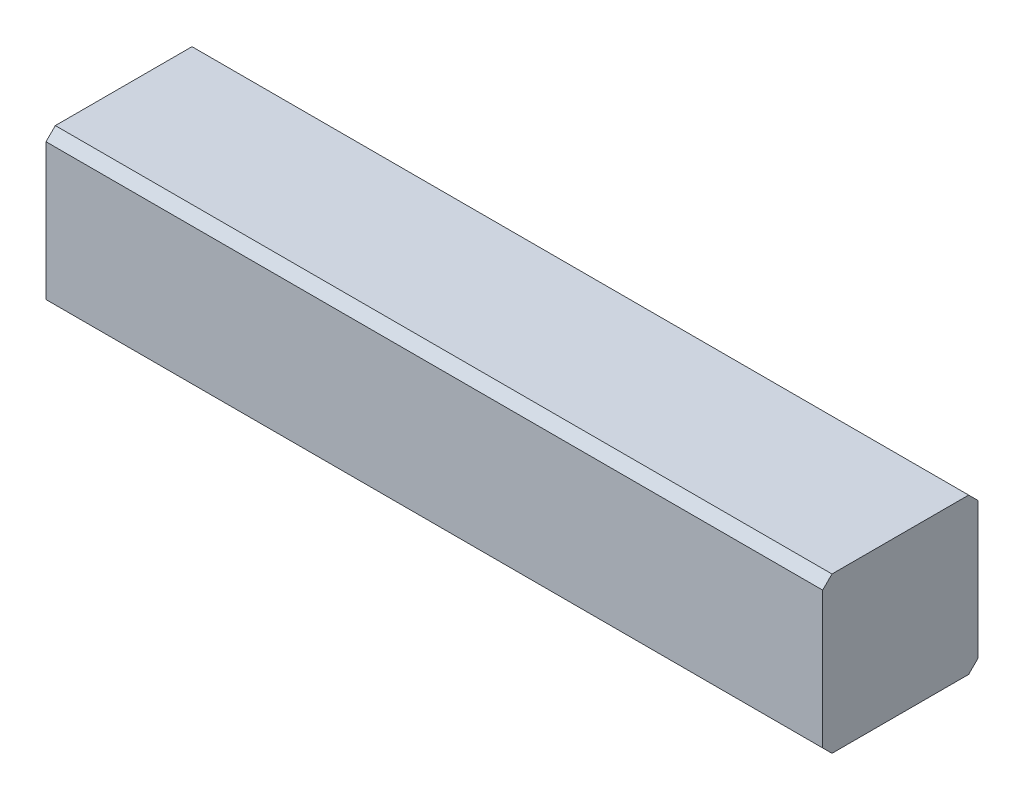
ISO-10303-21;
HEADER;
FILE_DESCRIPTION(('STEP AP214'),'2;1');
FILE_NAME('part.step','',(''),(''),'','','');
FILE_SCHEMA(('AUTOMOTIVE_DESIGN { 1 0 10303 214 1 1 1 1 }'));
ENDSEC;
DATA;
#1=APPLICATION_CONTEXT('core data for automotive mechanical design processes');
#2=APPLICATION_PROTOCOL_DEFINITION('international standard','automotive_design',2000,#1);
#3=PRODUCT_CONTEXT('',#1,'mechanical');
#4=PRODUCT('Part','Part','',(#3));
#5=PRODUCT_RELATED_PRODUCT_CATEGORY('part','',(#4));
#6=PRODUCT_DEFINITION_FORMATION('','',#4);
#7=PRODUCT_DEFINITION_CONTEXT('part definition',#1,'design');
#8=PRODUCT_DEFINITION('design','',#6,#7);
#9=PRODUCT_DEFINITION_SHAPE('','',#8);
#10=(LENGTH_UNIT() NAMED_UNIT(*) SI_UNIT(.MILLI.,.METRE.));
#11=(NAMED_UNIT(*) PLANE_ANGLE_UNIT() SI_UNIT($,.RADIAN.));
#12=(NAMED_UNIT(*) SI_UNIT($,.STERADIAN.) SOLID_ANGLE_UNIT());
#13=UNCERTAINTY_MEASURE_WITH_UNIT(LENGTH_MEASURE(1.E-05),#10,'distance_accuracy_value','');
#14=(GEOMETRIC_REPRESENTATION_CONTEXT(3) GLOBAL_UNCERTAINTY_ASSIGNED_CONTEXT((#13)) GLOBAL_UNIT_ASSIGNED_CONTEXT((#10,
#11,#12)) REPRESENTATION_CONTEXT('',''));
#15=CARTESIAN_POINT('',(0.,0.,0.));
#16=DIRECTION('',(0.,0.,1.));
#17=DIRECTION('',(1.,0.,0.));
#18=AXIS2_PLACEMENT_3D('',#15,#16,#17);
#19=CARTESIAN_POINT('',(0.,5.,5.));
#20=DIRECTION('',(1.,0.,0.));
#21=DIRECTION('',(0.,0.,-1.));
#22=AXIS2_PLACEMENT_3D('',#19,#20,#21);
#23=PLANE('',#22);
#24=DIRECTION('',(0.,0.,-1.));
#25=VECTOR('',#24,1.);
#26=CARTESIAN_POINT('',(0.,0.,5.));
#27=LINE('',#26,#25);
#28=CARTESIAN_POINT('',(0.,0.,4.7));
#29=VERTEX_POINT('',#28);
#30=CARTESIAN_POINT('',(0.,0.,0.3));
#31=VERTEX_POINT('',#30);
#32=EDGE_CURVE('E11',#29,#31,#27,.T.);
#33=ORIENTED_EDGE('',*,*,#32,.F.);
#34=DIRECTION('',(0.,-0.707106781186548,-0.707106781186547));
#35=VECTOR('',#34,1.);
#36=CARTESIAN_POINT('',(0.,0.3,5.));
#37=LINE('',#36,#35);
#38=CARTESIAN_POINT('',(0.,0.3,5.));
#39=VERTEX_POINT('',#38);
#40=EDGE_CURVE('E124',#39,#29,#37,.T.);
#41=ORIENTED_EDGE('',*,*,#40,.F.);
#42=DIRECTION('',(0.,-1.,0.));
#43=VECTOR('',#42,1.);
#44=CARTESIAN_POINT('',(0.,5.,5.));
#45=LINE('',#44,#43);
#46=CARTESIAN_POINT('',(0.,4.7,5.));
#47=VERTEX_POINT('',#46);
#48=EDGE_CURVE('E161',#47,#39,#45,.T.);
#49=ORIENTED_EDGE('',*,*,#48,.F.);
#50=DIRECTION('',(0.,-0.707106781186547,0.707106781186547));
#51=VECTOR('',#50,1.);
#52=CARTESIAN_POINT('',(0.,5.,4.7));
#53=LINE('',#52,#51);
#54=CARTESIAN_POINT('',(0.,5.,4.7));
#55=VERTEX_POINT('',#54);
#56=EDGE_CURVE('E71',#55,#47,#53,.T.);
#57=ORIENTED_EDGE('',*,*,#56,.F.);
#58=DIRECTION('',(0.,0.,-1.));
#59=VECTOR('',#58,1.);
#60=CARTESIAN_POINT('',(0.,5.,5.));
#61=LINE('',#60,#59);
#62=CARTESIAN_POINT('',(0.,5.,0.3));
#63=VERTEX_POINT('',#62);
#64=EDGE_CURVE('E151',#55,#63,#61,.T.);
#65=ORIENTED_EDGE('',*,*,#64,.T.);
#66=DIRECTION('',(0.,0.707106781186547,0.707106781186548));
#67=VECTOR('',#66,1.);
#68=CARTESIAN_POINT('',(0.,4.7,0.));
#69=LINE('',#68,#67);
#70=CARTESIAN_POINT('',(0.,4.7,0.));
#71=VERTEX_POINT('',#70);
#72=EDGE_CURVE('E194',#71,#63,#69,.T.);
#73=ORIENTED_EDGE('',*,*,#72,.F.);
#74=DIRECTION('',(0.,-1.,0.));
#75=VECTOR('',#74,1.);
#76=CARTESIAN_POINT('',(0.,5.,0.));
#77=LINE('',#76,#75);
#78=CARTESIAN_POINT('',(0.,0.3,0.));
#79=VERTEX_POINT('',#78);
#80=EDGE_CURVE('E162',#71,#79,#77,.T.);
#81=ORIENTED_EDGE('',*,*,#80,.T.);
#82=DIRECTION('',(0.,0.707106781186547,-0.707106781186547));
#83=VECTOR('',#82,1.);
#84=CARTESIAN_POINT('',(0.,0.,0.3));
#85=LINE('',#84,#83);
#86=EDGE_CURVE('E197',#31,#79,#85,.T.);
#87=ORIENTED_EDGE('',*,*,#86,.F.);
#88=EDGE_LOOP('',(#33,#41,#49,#57,#65,#73,#81,#87));
#89=FACE_BOUND('',#88,.T.);
#90=ADVANCED_FACE('F42',(#89),#23,.F.);
#91=CARTESIAN_POINT('',(0.,0.,5.));
#92=DIRECTION('',(0.,1.,0.));
#93=DIRECTION('',(0.,0.,1.));
#94=AXIS2_PLACEMENT_3D('',#91,#92,#93);
#95=PLANE('',#94);
#96=DIRECTION('',(0.,0.,-1.));
#97=VECTOR('',#96,1.);
#98=CARTESIAN_POINT('',(25.,0.,5.));
#99=LINE('',#98,#97);
#100=CARTESIAN_POINT('',(25.,0.,4.7));
#101=VERTEX_POINT('',#100);
#102=CARTESIAN_POINT('',(25.,0.,0.3));
#103=VERTEX_POINT('',#102);
#104=EDGE_CURVE('E50',#101,#103,#99,.T.);
#105=ORIENTED_EDGE('',*,*,#104,.F.);
#106=DIRECTION('',(-1.,0.,0.));
#107=VECTOR('',#106,1.);
#108=CARTESIAN_POINT('',(25.,0.,4.7));
#109=LINE('',#108,#107);
#110=EDGE_CURVE('E121',#101,#29,#109,.T.);
#111=ORIENTED_EDGE('',*,*,#110,.T.);
#112=ORIENTED_EDGE('',*,*,#32,.T.);
#113=DIRECTION('',(-1.,0.,0.));
#114=VECTOR('',#113,1.);
#115=CARTESIAN_POINT('',(25.,0.,0.3));
#116=LINE('',#115,#114);
#117=EDGE_CURVE('E130',#103,#31,#116,.T.);
#118=ORIENTED_EDGE('',*,*,#117,.F.);
#119=EDGE_LOOP('',(#105,#111,#112,#118));
#120=FACE_BOUND('',#119,.T.);
#121=ADVANCED_FACE('F144',(#120),#95,.F.);
#122=CARTESIAN_POINT('',(25.,0.,5.));
#123=DIRECTION('',(-1.,0.,0.));
#124=DIRECTION('',(0.,0.,1.));
#125=AXIS2_PLACEMENT_3D('',#122,#123,#124);
#126=PLANE('',#125);
#127=DIRECTION('',(0.,1.,0.));
#128=VECTOR('',#127,1.);
#129=CARTESIAN_POINT('',(25.,0.,5.));
#130=LINE('',#129,#128);
#131=CARTESIAN_POINT('',(25.,0.3,5.));
#132=VERTEX_POINT('',#131);
#133=CARTESIAN_POINT('',(25.,4.7,5.));
#134=VERTEX_POINT('',#133);
#135=EDGE_CURVE('E139',#132,#134,#130,.T.);
#136=ORIENTED_EDGE('',*,*,#135,.F.);
#137=DIRECTION('',(0.,-0.707106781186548,-0.707106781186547));
#138=VECTOR('',#137,1.);
#139=CARTESIAN_POINT('',(25.,0.3,5.));
#140=LINE('',#139,#138);
#141=EDGE_CURVE('E60',#132,#101,#140,.T.);
#142=ORIENTED_EDGE('',*,*,#141,.T.);
#143=ORIENTED_EDGE('',*,*,#104,.T.);
#144=DIRECTION('',(0.,0.707106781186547,-0.707106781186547));
#145=VECTOR('',#144,1.);
#146=CARTESIAN_POINT('',(25.,0.,0.3));
#147=LINE('',#146,#145);
#148=CARTESIAN_POINT('',(25.,0.3,0.));
#149=VERTEX_POINT('',#148);
#150=EDGE_CURVE('E141',#103,#149,#147,.T.);
#151=ORIENTED_EDGE('',*,*,#150,.T.);
#152=DIRECTION('',(0.,1.,0.));
#153=VECTOR('',#152,1.);
#154=CARTESIAN_POINT('',(25.,0.,0.));
#155=LINE('',#154,#153);
#156=CARTESIAN_POINT('',(25.,4.7,0.));
#157=VERTEX_POINT('',#156);
#158=EDGE_CURVE('E157',#149,#157,#155,.T.);
#159=ORIENTED_EDGE('',*,*,#158,.T.);
#160=DIRECTION('',(0.,0.707106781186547,0.707106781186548));
#161=VECTOR('',#160,1.);
#162=CARTESIAN_POINT('',(25.,4.7,0.));
#163=LINE('',#162,#161);
#164=CARTESIAN_POINT('',(25.,5.,0.3));
#165=VERTEX_POINT('',#164);
#166=EDGE_CURVE('E203',#157,#165,#163,.T.);
#167=ORIENTED_EDGE('',*,*,#166,.T.);
#168=DIRECTION('',(0.,0.,-1.));
#169=VECTOR('',#168,1.);
#170=CARTESIAN_POINT('',(25.,5.,5.));
#171=LINE('',#170,#169);
#172=CARTESIAN_POINT('',(25.,5.,4.7));
#173=VERTEX_POINT('',#172);
#174=EDGE_CURVE('E146',#173,#165,#171,.T.);
#175=ORIENTED_EDGE('',*,*,#174,.F.);
#176=DIRECTION('',(0.,-0.707106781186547,0.707106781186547));
#177=VECTOR('',#176,1.);
#178=CARTESIAN_POINT('',(25.,5.,4.7));
#179=LINE('',#178,#177);
#180=EDGE_CURVE('E191',#173,#134,#179,.T.);
#181=ORIENTED_EDGE('',*,*,#180,.T.);
#182=EDGE_LOOP('',(#136,#142,#143,#151,#159,#167,#175,#181));
#183=FACE_BOUND('',#182,.T.);
#184=ADVANCED_FACE('F135',(#183),#126,.F.);
#185=CARTESIAN_POINT('',(25.,5.,5.));
#186=DIRECTION('',(0.,-1.,0.));
#187=DIRECTION('',(0.,0.,-1.));
#188=AXIS2_PLACEMENT_3D('',#185,#186,#187);
#189=PLANE('',#188);
#190=ORIENTED_EDGE('',*,*,#174,.T.);
#191=DIRECTION('',(-1.,0.,0.));
#192=VECTOR('',#191,1.);
#193=CARTESIAN_POINT('',(25.,5.,0.3));
#194=LINE('',#193,#192);
#195=EDGE_CURVE('E181',#165,#63,#194,.T.);
#196=ORIENTED_EDGE('',*,*,#195,.T.);
#197=ORIENTED_EDGE('',*,*,#64,.F.);
#198=DIRECTION('',(-1.,0.,0.));
#199=VECTOR('',#198,1.);
#200=CARTESIAN_POINT('',(25.,5.,4.7));
#201=LINE('',#200,#199);
#202=EDGE_CURVE('E185',#173,#55,#201,.T.);
#203=ORIENTED_EDGE('',*,*,#202,.F.);
#204=EDGE_LOOP('',(#190,#196,#197,#203));
#205=FACE_BOUND('',#204,.T.);
#206=ADVANCED_FACE('F223',(#205),#189,.F.);
#207=CARTESIAN_POINT('',(0.,0.,5.));
#208=DIRECTION('',(0.,0.,1.));
#209=DIRECTION('',(1.,0.,0.));
#210=AXIS2_PLACEMENT_3D('',#207,#208,#209);
#211=PLANE('',#210);
#212=DIRECTION('',(-1.,0.,0.));
#213=VECTOR('',#212,1.);
#214=CARTESIAN_POINT('',(25.,0.3,5.));
#215=LINE('',#214,#213);
#216=EDGE_CURVE('E129',#132,#39,#215,.T.);
#217=ORIENTED_EDGE('',*,*,#216,.F.);
#218=ORIENTED_EDGE('',*,*,#135,.T.);
#219=DIRECTION('',(-1.,0.,0.));
#220=VECTOR('',#219,1.);
#221=CARTESIAN_POINT('',(25.,4.7,5.));
#222=LINE('',#221,#220);
#223=EDGE_CURVE('E188',#134,#47,#222,.T.);
#224=ORIENTED_EDGE('',*,*,#223,.T.);
#225=ORIENTED_EDGE('',*,*,#48,.T.);
#226=EDGE_LOOP('',(#217,#218,#224,#225));
#227=FACE_BOUND('',#226,.T.);
#228=ADVANCED_FACE('F226',(#227),#211,.T.);
#229=CARTESIAN_POINT('',(0.,0.,0.));
#230=DIRECTION('',(0.,0.,1.));
#231=DIRECTION('',(1.,0.,0.));
#232=AXIS2_PLACEMENT_3D('',#229,#230,#231);
#233=PLANE('',#232);
#234=ORIENTED_EDGE('',*,*,#158,.F.);
#235=DIRECTION('',(-1.,0.,0.));
#236=VECTOR('',#235,1.);
#237=CARTESIAN_POINT('',(25.,0.3,0.));
#238=LINE('',#237,#236);
#239=EDGE_CURVE('E174',#149,#79,#238,.T.);
#240=ORIENTED_EDGE('',*,*,#239,.T.);
#241=ORIENTED_EDGE('',*,*,#80,.F.);
#242=DIRECTION('',(-1.,0.,0.));
#243=VECTOR('',#242,1.);
#244=CARTESIAN_POINT('',(25.,4.7,0.));
#245=LINE('',#244,#243);
#246=EDGE_CURVE('E178',#157,#71,#245,.T.);
#247=ORIENTED_EDGE('',*,*,#246,.F.);
#248=EDGE_LOOP('',(#234,#240,#241,#247));
#249=FACE_BOUND('',#248,.T.);
#250=ADVANCED_FACE('F212',(#249),#233,.F.);
#251=CARTESIAN_POINT('',(25.,4.7,0.));
#252=DIRECTION('',(0.,-0.707106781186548,0.707106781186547));
#253=DIRECTION('',(0.,-0.707106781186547,-0.707106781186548));
#254=AXIS2_PLACEMENT_3D('',#251,#252,#253);
#255=PLANE('',#254);
#256=ORIENTED_EDGE('',*,*,#72,.T.);
#257=ORIENTED_EDGE('',*,*,#195,.F.);
#258=ORIENTED_EDGE('',*,*,#166,.F.);
#259=ORIENTED_EDGE('',*,*,#246,.T.);
#260=EDGE_LOOP('',(#256,#257,#258,#259));
#261=FACE_BOUND('',#260,.T.);
#262=ADVANCED_FACE('F216',(#261),#255,.F.);
#263=CARTESIAN_POINT('',(25.,0.,0.3));
#264=DIRECTION('',(0.,0.707106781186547,0.707106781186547));
#265=DIRECTION('',(0.,-0.707106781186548,0.707106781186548));
#266=AXIS2_PLACEMENT_3D('',#263,#264,#265);
#267=PLANE('',#266);
#268=ORIENTED_EDGE('',*,*,#86,.T.);
#269=ORIENTED_EDGE('',*,*,#239,.F.);
#270=ORIENTED_EDGE('',*,*,#150,.F.);
#271=ORIENTED_EDGE('',*,*,#117,.T.);
#272=EDGE_LOOP('',(#268,#269,#270,#271));
#273=FACE_BOUND('',#272,.T.);
#274=ADVANCED_FACE('F227',(#273),#267,.F.);
#275=CARTESIAN_POINT('',(25.,5.,4.7));
#276=DIRECTION('',(0.,-0.707106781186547,-0.707106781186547));
#277=DIRECTION('',(0.,0.707106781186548,-0.707106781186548));
#278=AXIS2_PLACEMENT_3D('',#275,#276,#277);
#279=PLANE('',#278);
#280=ORIENTED_EDGE('',*,*,#56,.T.);
#281=ORIENTED_EDGE('',*,*,#223,.F.);
#282=ORIENTED_EDGE('',*,*,#180,.F.);
#283=ORIENTED_EDGE('',*,*,#202,.T.);
#284=EDGE_LOOP('',(#280,#281,#282,#283));
#285=FACE_BOUND('',#284,.T.);
#286=ADVANCED_FACE('F229',(#285),#279,.F.);
#287=CARTESIAN_POINT('',(25.,0.3,5.));
#288=DIRECTION('',(0.,0.707106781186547,-0.707106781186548));
#289=DIRECTION('',(0.,0.707106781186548,0.707106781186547));
#290=AXIS2_PLACEMENT_3D('',#287,#288,#289);
#291=PLANE('',#290);
#292=ORIENTED_EDGE('',*,*,#40,.T.);
#293=ORIENTED_EDGE('',*,*,#110,.F.);
#294=ORIENTED_EDGE('',*,*,#141,.F.);
#295=ORIENTED_EDGE('',*,*,#216,.T.);
#296=EDGE_LOOP('',(#292,#293,#294,#295));
#297=FACE_BOUND('',#296,.T.);
#298=ADVANCED_FACE('F122',(#297),#291,.F.);
#299=CLOSED_SHELL('',(#90,#121,#184,#206,#228,#250,#262,#274,#286,#298));
#300=MANIFOLD_SOLID_BREP('B2',#299);
#301=ADVANCED_BREP_SHAPE_REPRESENTATION('',(#18,#300),#14);
#302=SHAPE_DEFINITION_REPRESENTATION(#9,#301);
ENDSEC;
END-ISO-10303-21;
